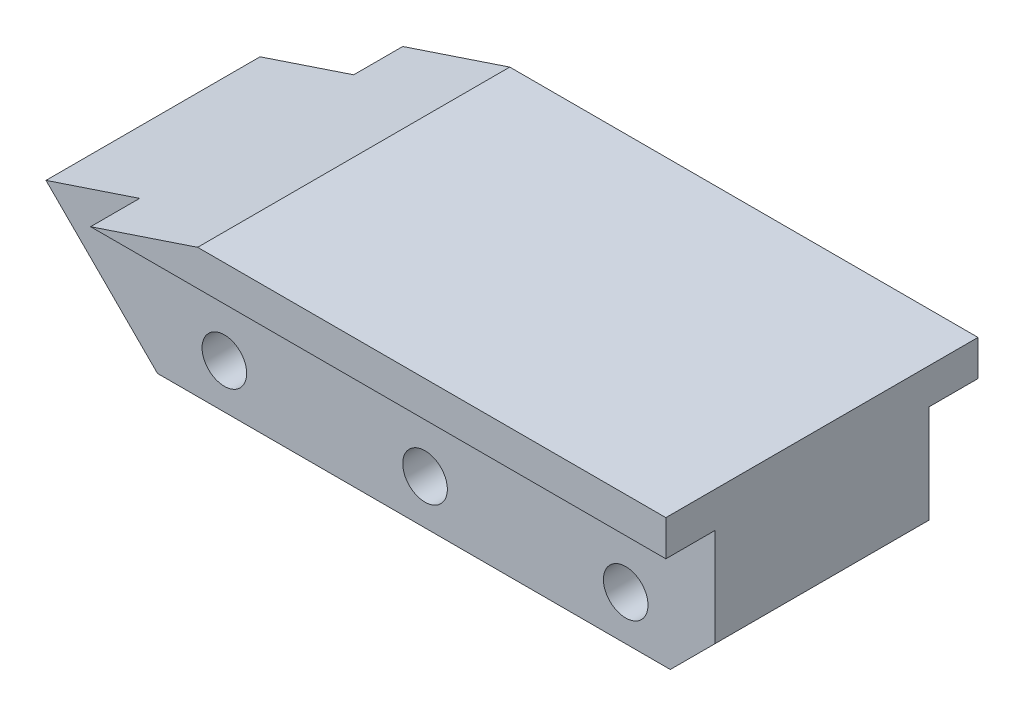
ISO-10303-21;
HEADER;
FILE_DESCRIPTION(('STEP AP214'),'2;1');
FILE_NAME('part.step','',(''),(''),'','','');
FILE_SCHEMA(('AUTOMOTIVE_DESIGN { 1 0 10303 214 1 1 1 1 }'));
ENDSEC;
DATA;
#1=APPLICATION_CONTEXT('core data for automotive mechanical design processes');
#2=APPLICATION_PROTOCOL_DEFINITION('international standard','automotive_design',2000,#1);
#3=PRODUCT_CONTEXT('',#1,'mechanical');
#4=PRODUCT('Part','Part','',(#3));
#5=PRODUCT_RELATED_PRODUCT_CATEGORY('part','',(#4));
#6=PRODUCT_DEFINITION_FORMATION('','',#4);
#7=PRODUCT_DEFINITION_CONTEXT('part definition',#1,'design');
#8=PRODUCT_DEFINITION('design','',#6,#7);
#9=PRODUCT_DEFINITION_SHAPE('','',#8);
#10=(LENGTH_UNIT() NAMED_UNIT(*) SI_UNIT(.MILLI.,.METRE.));
#11=(NAMED_UNIT(*) PLANE_ANGLE_UNIT() SI_UNIT($,.RADIAN.));
#12=(NAMED_UNIT(*) SI_UNIT($,.STERADIAN.) SOLID_ANGLE_UNIT());
#13=UNCERTAINTY_MEASURE_WITH_UNIT(LENGTH_MEASURE(1.E-05),#10,'distance_accuracy_value','');
#14=(GEOMETRIC_REPRESENTATION_CONTEXT(3) GLOBAL_UNCERTAINTY_ASSIGNED_CONTEXT((#13)) GLOBAL_UNIT_ASSIGNED_CONTEXT((#10,
#11,#12)) REPRESENTATION_CONTEXT('',''));
#15=CARTESIAN_POINT('',(0.,0.,0.));
#16=DIRECTION('',(0.,0.,1.));
#17=DIRECTION('',(1.,0.,0.));
#18=AXIS2_PLACEMENT_3D('',#15,#16,#17);
#19=CARTESIAN_POINT('',(100.120479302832,-22.0237691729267,70.));
#20=DIRECTION('',(0.,0.,1.));
#21=DIRECTION('',(1.,0.,0.));
#22=AXIS2_PLACEMENT_3D('',#19,#20,#21);
#23=PLANE('',#22);
#24=DIRECTION('',(1.,0.,0.));
#25=VECTOR('',#24,1.);
#26=CARTESIAN_POINT('',(-49.8795206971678,9.97623082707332,70.));
#27=LINE('',#26,#25);
#28=CARTESIAN_POINT('',(-28.8795206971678,9.97623082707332,70.));
#29=VERTEX_POINT('',#28);
#30=CARTESIAN_POINT('',(100.120479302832,9.97623082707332,70.));
#31=VERTEX_POINT('',#30);
#32=EDGE_CURVE('E163',#29,#31,#27,.T.);
#33=ORIENTED_EDGE('',*,*,#32,.T.);
#34=DIRECTION('',(0.,1.,0.));
#35=VECTOR('',#34,1.);
#36=CARTESIAN_POINT('',(100.120479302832,17.9762308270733,70.));
#37=LINE('',#36,#35);
#38=CARTESIAN_POINT('',(100.120479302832,17.9762308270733,70.));
#39=VERTEX_POINT('',#38);
#40=EDGE_CURVE('E146',#31,#39,#37,.T.);
#41=ORIENTED_EDGE('',*,*,#40,.T.);
#42=DIRECTION('',(-1.,0.,0.));
#43=VECTOR('',#42,1.);
#44=CARTESIAN_POINT('',(-4.87952069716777,17.9762308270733,70.));
#45=LINE('',#44,#43);
#46=CARTESIAN_POINT('',(-4.87952069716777,17.9762308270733,70.));
#47=VERTEX_POINT('',#46);
#48=EDGE_CURVE('E212',#39,#47,#45,.T.);
#49=ORIENTED_EDGE('',*,*,#48,.T.);
#50=DIRECTION('',(-0.948683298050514,-0.316227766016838,0.));
#51=VECTOR('',#50,1.);
#52=CARTESIAN_POINT('',(-49.8795206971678,2.97623082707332,70.));
#53=LINE('',#52,#51);
#54=EDGE_CURVE('E142',#47,#29,#53,.T.);
#55=ORIENTED_EDGE('',*,*,#54,.T.);
#56=EDGE_LOOP('',(#33,#41,#49,#55));
#57=FACE_BOUND('',#56,.T.);
#58=ADVANCED_FACE('F32',(#57),#23,.T.);
#59=CARTESIAN_POINT('',(100.120479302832,-22.0237691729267,0.));
#60=DIRECTION('',(0.,0.,1.));
#61=DIRECTION('',(1.,0.,0.));
#62=AXIS2_PLACEMENT_3D('',#59,#60,#61);
#63=PLANE('',#62);
#64=DIRECTION('',(0.,1.,0.));
#65=VECTOR('',#64,1.);
#66=CARTESIAN_POINT('',(100.120479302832,17.9762308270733,0.));
#67=LINE('',#66,#65);
#68=CARTESIAN_POINT('',(100.120479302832,9.97623082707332,0.));
#69=VERTEX_POINT('',#68);
#70=CARTESIAN_POINT('',(100.120479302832,17.9762308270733,0.));
#71=VERTEX_POINT('',#70);
#72=EDGE_CURVE('E127',#69,#71,#67,.T.);
#73=ORIENTED_EDGE('',*,*,#72,.F.);
#74=DIRECTION('',(1.,0.,0.));
#75=VECTOR('',#74,1.);
#76=CARTESIAN_POINT('',(-49.8795206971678,9.97623082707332,0.));
#77=LINE('',#76,#75);
#78=CARTESIAN_POINT('',(-28.8795206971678,9.97623082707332,0.));
#79=VERTEX_POINT('',#78);
#80=EDGE_CURVE('E108',#79,#69,#77,.T.);
#81=ORIENTED_EDGE('',*,*,#80,.F.);
#82=DIRECTION('',(-0.948683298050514,-0.316227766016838,0.));
#83=VECTOR('',#82,1.);
#84=CARTESIAN_POINT('',(-49.8795206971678,2.97623082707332,0.));
#85=LINE('',#84,#83);
#86=CARTESIAN_POINT('',(-4.87952069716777,17.9762308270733,0.));
#87=VERTEX_POINT('',#86);
#88=EDGE_CURVE('E136',#87,#79,#85,.T.);
#89=ORIENTED_EDGE('',*,*,#88,.F.);
#90=DIRECTION('',(-1.,0.,0.));
#91=VECTOR('',#90,1.);
#92=CARTESIAN_POINT('',(-4.87952069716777,17.9762308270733,0.));
#93=LINE('',#92,#91);
#94=EDGE_CURVE('E132',#71,#87,#93,.T.);
#95=ORIENTED_EDGE('',*,*,#94,.F.);
#96=EDGE_LOOP('',(#73,#81,#89,#95));
#97=FACE_BOUND('',#96,.T.);
#98=ADVANCED_FACE('F131',(#97),#63,.F.);
#99=CARTESIAN_POINT('',(100.120479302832,17.9762308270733,70.));
#100=DIRECTION('',(-1.,0.,0.));
#101=DIRECTION('',(0.,0.,1.));
#102=AXIS2_PLACEMENT_3D('',#99,#100,#101);
#103=PLANE('',#102);
#104=DIRECTION('',(0.,1.,0.));
#105=VECTOR('',#104,1.);
#106=CARTESIAN_POINT('',(100.120479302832,9.97623082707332,59.));
#107=LINE('',#106,#105);
#108=CARTESIAN_POINT('',(100.120479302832,-12.0237691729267,59.));
#109=VERTEX_POINT('',#108);
#110=CARTESIAN_POINT('',(100.120479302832,9.97623082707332,59.));
#111=VERTEX_POINT('',#110);
#112=EDGE_CURVE('E176',#109,#111,#107,.T.);
#113=ORIENTED_EDGE('',*,*,#112,.F.);
#114=DIRECTION('',(0.,0.,-1.));
#115=VECTOR('',#114,1.);
#116=CARTESIAN_POINT('',(100.120479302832,-12.0237691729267,70.));
#117=LINE('',#116,#115);
#118=CARTESIAN_POINT('',(100.120479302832,-12.0237691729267,11.));
#119=VERTEX_POINT('',#118);
#120=EDGE_CURVE('E172',#109,#119,#117,.T.);
#121=ORIENTED_EDGE('',*,*,#120,.T.);
#122=DIRECTION('',(0.,-1.,0.));
#123=VECTOR('',#122,1.);
#124=CARTESIAN_POINT('',(100.120479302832,9.97623082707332,11.));
#125=LINE('',#124,#123);
#126=CARTESIAN_POINT('',(100.120479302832,9.97623082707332,11.));
#127=VERTEX_POINT('',#126);
#128=EDGE_CURVE('E121',#127,#119,#125,.T.);
#129=ORIENTED_EDGE('',*,*,#128,.F.);
#130=DIRECTION('',(0.,0.,1.));
#131=VECTOR('',#130,1.);
#132=CARTESIAN_POINT('',(100.120479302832,9.97623082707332,0.));
#133=LINE('',#132,#131);
#134=EDGE_CURVE('E112',#69,#127,#133,.T.);
#135=ORIENTED_EDGE('',*,*,#134,.F.);
#136=ORIENTED_EDGE('',*,*,#72,.T.);
#137=DIRECTION('',(0.,0.,-1.));
#138=VECTOR('',#137,1.);
#139=CARTESIAN_POINT('',(100.120479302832,17.9762308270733,70.));
#140=LINE('',#139,#138);
#141=EDGE_CURVE('E156',#39,#71,#140,.T.);
#142=ORIENTED_EDGE('',*,*,#141,.F.);
#143=ORIENTED_EDGE('',*,*,#40,.F.);
#144=DIRECTION('',(0.,0.,1.));
#145=VECTOR('',#144,1.);
#146=CARTESIAN_POINT('',(100.120479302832,9.97623082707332,70.));
#147=LINE('',#146,#145);
#148=EDGE_CURVE('E196',#111,#31,#147,.T.);
#149=ORIENTED_EDGE('',*,*,#148,.F.);
#150=EDGE_LOOP('',(#113,#121,#129,#135,#136,#142,#143,#149));
#151=FACE_BOUND('',#150,.T.);
#152=ADVANCED_FACE('F125',(#151),#103,.F.);
#153=CARTESIAN_POINT('',(-4.87952069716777,17.9762308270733,70.));
#154=DIRECTION('',(0.,-1.,0.));
#155=DIRECTION('',(0.,0.,-1.));
#156=AXIS2_PLACEMENT_3D('',#153,#154,#155);
#157=PLANE('',#156);
#158=ORIENTED_EDGE('',*,*,#94,.T.);
#159=DIRECTION('',(0.,0.,-1.));
#160=VECTOR('',#159,1.);
#161=CARTESIAN_POINT('',(-4.87952069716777,17.9762308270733,70.));
#162=LINE('',#161,#160);
#163=EDGE_CURVE('E153',#47,#87,#162,.T.);
#164=ORIENTED_EDGE('',*,*,#163,.F.);
#165=ORIENTED_EDGE('',*,*,#48,.F.);
#166=ORIENTED_EDGE('',*,*,#141,.T.);
#167=EDGE_LOOP('',(#158,#164,#165,#166));
#168=FACE_BOUND('',#167,.T.);
#169=ADVANCED_FACE('F252',(#168),#157,.F.);
#170=CARTESIAN_POINT('',(-49.8795206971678,2.97623082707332,70.));
#171=DIRECTION('',(0.316227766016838,-0.948683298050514,0.));
#172=DIRECTION('',(0.948683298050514,0.316227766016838,0.));
#173=AXIS2_PLACEMENT_3D('',#170,#171,#172);
#174=PLANE('',#173);
#175=DIRECTION('',(0.,0.,1.));
#176=VECTOR('',#175,1.);
#177=CARTESIAN_POINT('',(-28.8795206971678,9.97623082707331,70.));
#178=LINE('',#177,#176);
#179=CARTESIAN_POINT('',(-28.8795206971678,9.97623082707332,11.));
#180=VERTEX_POINT('',#179);
#181=EDGE_CURVE('E115',#79,#180,#178,.T.);
#182=ORIENTED_EDGE('',*,*,#181,.T.);
#183=DIRECTION('',(-0.948683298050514,-0.316227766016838,0.));
#184=VECTOR('',#183,1.);
#185=CARTESIAN_POINT('',(-49.8795206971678,2.97623082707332,11.));
#186=LINE('',#185,#184);
#187=CARTESIAN_POINT('',(-49.8795206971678,2.97623082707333,11.));
#188=VERTEX_POINT('',#187);
#189=EDGE_CURVE('E192',#180,#188,#186,.T.);
#190=ORIENTED_EDGE('',*,*,#189,.T.);
#191=DIRECTION('',(0.,0.,-1.));
#192=VECTOR('',#191,1.);
#193=CARTESIAN_POINT('',(-49.8795206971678,2.97623082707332,70.));
#194=LINE('',#193,#192);
#195=CARTESIAN_POINT('',(-49.8795206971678,2.97623082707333,59.));
#196=VERTEX_POINT('',#195);
#197=EDGE_CURVE('E150',#196,#188,#194,.T.);
#198=ORIENTED_EDGE('',*,*,#197,.F.);
#199=DIRECTION('',(0.948683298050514,0.316227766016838,0.));
#200=VECTOR('',#199,1.);
#201=CARTESIAN_POINT('',(-49.8795206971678,2.97623082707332,59.));
#202=LINE('',#201,#200);
#203=CARTESIAN_POINT('',(-28.8795206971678,9.97623082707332,59.));
#204=VERTEX_POINT('',#203);
#205=EDGE_CURVE('E134',#196,#204,#202,.T.);
#206=ORIENTED_EDGE('',*,*,#205,.T.);
#207=DIRECTION('',(0.,0.,1.));
#208=VECTOR('',#207,1.);
#209=CARTESIAN_POINT('',(-28.8795206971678,9.97623082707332,70.));
#210=LINE('',#209,#208);
#211=EDGE_CURVE('E158',#204,#29,#210,.T.);
#212=ORIENTED_EDGE('',*,*,#211,.T.);
#213=ORIENTED_EDGE('',*,*,#54,.F.);
#214=ORIENTED_EDGE('',*,*,#163,.T.);
#215=ORIENTED_EDGE('',*,*,#88,.T.);
#216=EDGE_LOOP('',(#182,#190,#198,#206,#212,#213,#214,#215));
#217=FACE_BOUND('',#216,.T.);
#218=ADVANCED_FACE('F220',(#217),#174,.F.);
#219=CARTESIAN_POINT('',(-49.8795206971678,2.97623082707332,70.));
#220=DIRECTION('',(0.707106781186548,0.707106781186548,0.));
#221=DIRECTION('',(-0.707106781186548,0.707106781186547,0.));
#222=AXIS2_PLACEMENT_3D('',#219,#220,#221);
#223=PLANE('',#222);
#224=ORIENTED_EDGE('',*,*,#197,.T.);
#225=DIRECTION('',(0.707106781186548,-0.707106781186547,0.));
#226=VECTOR('',#225,1.);
#227=CARTESIAN_POINT('',(-49.8795206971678,2.97623082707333,11.));
#228=LINE('',#227,#226);
#229=CARTESIAN_POINT('',(-24.8795206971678,-22.0237691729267,11.));
#230=VERTEX_POINT('',#229);
#231=EDGE_CURVE('E189',#188,#230,#228,.T.);
#232=ORIENTED_EDGE('',*,*,#231,.T.);
#233=DIRECTION('',(0.,0.,-1.));
#234=VECTOR('',#233,1.);
#235=CARTESIAN_POINT('',(-24.8795206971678,-22.0237691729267,70.));
#236=LINE('',#235,#234);
#237=CARTESIAN_POINT('',(-24.8795206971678,-22.0237691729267,59.));
#238=VERTEX_POINT('',#237);
#239=EDGE_CURVE('E147',#238,#230,#236,.T.);
#240=ORIENTED_EDGE('',*,*,#239,.F.);
#241=DIRECTION('',(-0.707106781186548,0.707106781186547,0.));
#242=VECTOR('',#241,1.);
#243=CARTESIAN_POINT('',(-49.8795206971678,2.97623082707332,59.));
#244=LINE('',#243,#242);
#245=EDGE_CURVE('E139',#238,#196,#244,.T.);
#246=ORIENTED_EDGE('',*,*,#245,.T.);
#247=EDGE_LOOP('',(#224,#232,#240,#246));
#248=FACE_BOUND('',#247,.T.);
#249=ADVANCED_FACE('F246',(#248),#223,.F.);
#250=CARTESIAN_POINT('',(-24.8795206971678,-22.0237691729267,70.));
#251=DIRECTION('',(0.,1.,0.));
#252=DIRECTION('',(0.,0.,1.));
#253=AXIS2_PLACEMENT_3D('',#250,#251,#252);
#254=PLANE('',#253);
#255=DIRECTION('',(1.,0.,0.));
#256=VECTOR('',#255,1.);
#257=CARTESIAN_POINT('',(-49.8795206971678,-22.0237691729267,11.));
#258=LINE('',#257,#256);
#259=CARTESIAN_POINT('',(90.1204793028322,-22.0237691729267,11.));
#260=VERTEX_POINT('',#259);
#261=EDGE_CURVE('E170',#230,#260,#258,.T.);
#262=ORIENTED_EDGE('',*,*,#261,.T.);
#263=DIRECTION('',(0.,0.,1.));
#264=VECTOR('',#263,1.);
#265=CARTESIAN_POINT('',(90.1204793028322,-22.0237691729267,70.));
#266=LINE('',#265,#264);
#267=CARTESIAN_POINT('',(90.1204793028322,-22.0237691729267,59.));
#268=VERTEX_POINT('',#267);
#269=EDGE_CURVE('E40',#260,#268,#266,.T.);
#270=ORIENTED_EDGE('',*,*,#269,.T.);
#271=DIRECTION('',(1.,0.,0.));
#272=VECTOR('',#271,1.);
#273=CARTESIAN_POINT('',(-49.8795206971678,-22.0237691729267,59.));
#274=LINE('',#273,#272);
#275=EDGE_CURVE('E198',#238,#268,#274,.T.);
#276=ORIENTED_EDGE('',*,*,#275,.F.);
#277=ORIENTED_EDGE('',*,*,#239,.T.);
#278=EDGE_LOOP('',(#262,#270,#276,#277));
#279=FACE_BOUND('',#278,.T.);
#280=ADVANCED_FACE('F243',(#279),#254,.F.);
#281=CARTESIAN_POINT('',(80.1204793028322,-12.0237691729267,70.));
#282=DIRECTION('',(0.,0.,-1.));
#283=DIRECTION('',(-1.,0.,0.));
#284=AXIS2_PLACEMENT_3D('',#281,#282,#283);
#285=CYLINDRICAL_SURFACE('',#284,5.);
#286=CARTESIAN_POINT('',(80.1204793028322,-12.0237691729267,11.));
#287=DIRECTION('',(0.,0.,1.));
#288=DIRECTION('',(0.,-1.,0.));
#289=AXIS2_PLACEMENT_3D('',#286,#287,#288);
#290=CIRCLE('',#289,5.);
#291=CARTESIAN_POINT('',(80.1204793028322,-17.0237691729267,11.));
#292=VERTEX_POINT('',#291);
#293=EDGE_CURVE('E186',#292,#292,#290,.T.);
#294=ORIENTED_EDGE('',*,*,#293,.F.);
#295=EDGE_LOOP('',(#294));
#296=FACE_BOUND('',#295,.T.);
#297=CARTESIAN_POINT('',(80.1204793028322,-12.0237691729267,59.));
#298=DIRECTION('',(0.,0.,-1.));
#299=DIRECTION('',(-1.,0.,0.));
#300=AXIS2_PLACEMENT_3D('',#297,#298,#299);
#301=CIRCLE('',#300,5.);
#302=CARTESIAN_POINT('',(75.1204793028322,-12.0237691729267,59.));
#303=VERTEX_POINT('',#302);
#304=EDGE_CURVE('E207',#303,#303,#301,.T.);
#305=ORIENTED_EDGE('',*,*,#304,.F.);
#306=EDGE_LOOP('',(#305));
#307=FACE_BOUND('',#306,.T.);
#308=ADVANCED_FACE('F240',(#296,#307),#285,.F.);
#309=CARTESIAN_POINT('',(35.1204793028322,-12.0237691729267,70.));
#310=DIRECTION('',(0.,0.,-1.));
#311=DIRECTION('',(-1.,0.,0.));
#312=AXIS2_PLACEMENT_3D('',#309,#310,#311);
#313=CYLINDRICAL_SURFACE('',#312,5.);
#314=CARTESIAN_POINT('',(35.1204793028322,-12.0237691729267,11.));
#315=DIRECTION('',(0.,0.,1.));
#316=DIRECTION('',(0.,-1.,0.));
#317=AXIS2_PLACEMENT_3D('',#314,#315,#316);
#318=CIRCLE('',#317,5.);
#319=CARTESIAN_POINT('',(35.1204793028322,-17.0237691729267,11.));
#320=VERTEX_POINT('',#319);
#321=EDGE_CURVE('E169',#320,#320,#318,.T.);
#322=ORIENTED_EDGE('',*,*,#321,.F.);
#323=EDGE_LOOP('',(#322));
#324=FACE_BOUND('',#323,.T.);
#325=CARTESIAN_POINT('',(35.1204793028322,-12.0237691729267,59.));
#326=DIRECTION('',(0.,0.,-1.));
#327=DIRECTION('',(-1.,0.,0.));
#328=AXIS2_PLACEMENT_3D('',#325,#326,#327);
#329=CIRCLE('',#328,5.);
#330=CARTESIAN_POINT('',(30.1204793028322,-12.0237691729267,59.));
#331=VERTEX_POINT('',#330);
#332=EDGE_CURVE('E162',#331,#331,#329,.T.);
#333=ORIENTED_EDGE('',*,*,#332,.F.);
#334=EDGE_LOOP('',(#333));
#335=FACE_BOUND('',#334,.T.);
#336=ADVANCED_FACE('F282',(#324,#335),#313,.F.);
#337=CARTESIAN_POINT('',(-9.87952069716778,-12.0237691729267,70.));
#338=DIRECTION('',(0.,0.,-1.));
#339=DIRECTION('',(-1.,0.,0.));
#340=AXIS2_PLACEMENT_3D('',#337,#338,#339);
#341=CYLINDRICAL_SURFACE('',#340,5.);
#342=CARTESIAN_POINT('',(-9.87952069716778,-12.0237691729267,11.));
#343=DIRECTION('',(0.,0.,1.));
#344=DIRECTION('',(0.,-1.,0.));
#345=AXIS2_PLACEMENT_3D('',#342,#343,#344);
#346=CIRCLE('',#345,5.);
#347=CARTESIAN_POINT('',(-9.87952069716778,-17.0237691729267,11.));
#348=VERTEX_POINT('',#347);
#349=EDGE_CURVE('E166',#348,#348,#346,.T.);
#350=ORIENTED_EDGE('',*,*,#349,.F.);
#351=EDGE_LOOP('',(#350));
#352=FACE_BOUND('',#351,.T.);
#353=CARTESIAN_POINT('',(-9.87952069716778,-12.0237691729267,59.));
#354=DIRECTION('',(0.,0.,-1.));
#355=DIRECTION('',(-1.,0.,0.));
#356=AXIS2_PLACEMENT_3D('',#353,#354,#355);
#357=CIRCLE('',#356,5.);
#358=CARTESIAN_POINT('',(-14.8795206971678,-12.0237691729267,59.));
#359=VERTEX_POINT('',#358);
#360=EDGE_CURVE('E159',#359,#359,#357,.T.);
#361=ORIENTED_EDGE('',*,*,#360,.F.);
#362=EDGE_LOOP('',(#361));
#363=FACE_BOUND('',#362,.T.);
#364=ADVANCED_FACE('F289',(#352,#363),#341,.F.);
#365=CARTESIAN_POINT('',(-49.8795206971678,9.97623082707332,70.));
#366=DIRECTION('',(0.,1.,0.));
#367=DIRECTION('',(0.,0.,1.));
#368=AXIS2_PLACEMENT_3D('',#365,#366,#367);
#369=PLANE('',#368);
#370=DIRECTION('',(1.,0.,0.));
#371=VECTOR('',#370,1.);
#372=CARTESIAN_POINT('',(-49.8795206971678,9.97623082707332,59.));
#373=LINE('',#372,#371);
#374=EDGE_CURVE('E201',#204,#111,#373,.T.);
#375=ORIENTED_EDGE('',*,*,#374,.T.);
#376=ORIENTED_EDGE('',*,*,#148,.T.);
#377=ORIENTED_EDGE('',*,*,#32,.F.);
#378=ORIENTED_EDGE('',*,*,#211,.F.);
#379=EDGE_LOOP('',(#375,#376,#377,#378));
#380=FACE_BOUND('',#379,.T.);
#381=ADVANCED_FACE('F224',(#380),#369,.F.);
#382=CARTESIAN_POINT('',(-49.8795206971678,9.97623082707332,59.));
#383=DIRECTION('',(0.,0.,-1.));
#384=DIRECTION('',(-1.,0.,0.));
#385=AXIS2_PLACEMENT_3D('',#382,#383,#384);
#386=PLANE('',#385);
#387=ORIENTED_EDGE('',*,*,#304,.T.);
#388=EDGE_LOOP('',(#387));
#389=FACE_BOUND('',#388,.T.);
#390=ORIENTED_EDGE('',*,*,#332,.T.);
#391=EDGE_LOOP('',(#390));
#392=FACE_BOUND('',#391,.T.);
#393=ORIENTED_EDGE('',*,*,#360,.T.);
#394=EDGE_LOOP('',(#393));
#395=FACE_BOUND('',#394,.T.);
#396=ORIENTED_EDGE('',*,*,#275,.T.);
#397=DIRECTION('',(-0.707106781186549,-0.707106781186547,0.));
#398=VECTOR('',#397,1.);
#399=CARTESIAN_POINT('',(100.120479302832,-12.0237691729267,59.));
#400=LINE('',#399,#398);
#401=EDGE_CURVE('E11',#268,#109,#400,.F.);
#402=ORIENTED_EDGE('',*,*,#401,.T.);
#403=ORIENTED_EDGE('',*,*,#112,.T.);
#404=ORIENTED_EDGE('',*,*,#374,.F.);
#405=ORIENTED_EDGE('',*,*,#205,.F.);
#406=ORIENTED_EDGE('',*,*,#245,.F.);
#407=EDGE_LOOP('',(#396,#402,#403,#404,#405,#406));
#408=FACE_BOUND('',#407,.T.);
#409=ADVANCED_FACE('F226',(#389,#392,#395,#408),#386,.F.);
#410=CARTESIAN_POINT('',(-49.8795206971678,9.97623082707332,0.));
#411=DIRECTION('',(0.,1.,0.));
#412=DIRECTION('',(0.,0.,1.));
#413=AXIS2_PLACEMENT_3D('',#410,#411,#412);
#414=PLANE('',#413);
#415=ORIENTED_EDGE('',*,*,#80,.T.);
#416=ORIENTED_EDGE('',*,*,#134,.T.);
#417=DIRECTION('',(1.,0.,0.));
#418=VECTOR('',#417,1.);
#419=CARTESIAN_POINT('',(-49.8795206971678,9.97623082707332,11.));
#420=LINE('',#419,#418);
#421=EDGE_CURVE('E120',#180,#127,#420,.T.);
#422=ORIENTED_EDGE('',*,*,#421,.F.);
#423=ORIENTED_EDGE('',*,*,#181,.F.);
#424=EDGE_LOOP('',(#415,#416,#422,#423));
#425=FACE_BOUND('',#424,.T.);
#426=ADVANCED_FACE('F110',(#425),#414,.F.);
#427=CARTESIAN_POINT('',(-49.8795206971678,9.97623082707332,11.));
#428=DIRECTION('',(0.,0.,1.));
#429=DIRECTION('',(0.,-1.,0.));
#430=AXIS2_PLACEMENT_3D('',#427,#428,#429);
#431=PLANE('',#430);
#432=ORIENTED_EDGE('',*,*,#293,.T.);
#433=EDGE_LOOP('',(#432));
#434=FACE_BOUND('',#433,.T.);
#435=ORIENTED_EDGE('',*,*,#321,.T.);
#436=EDGE_LOOP('',(#435));
#437=FACE_BOUND('',#436,.T.);
#438=ORIENTED_EDGE('',*,*,#349,.T.);
#439=EDGE_LOOP('',(#438));
#440=FACE_BOUND('',#439,.T.);
#441=ORIENTED_EDGE('',*,*,#128,.T.);
#442=DIRECTION('',(0.707106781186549,0.707106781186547,0.));
#443=VECTOR('',#442,1.);
#444=CARTESIAN_POINT('',(100.120479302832,-12.0237691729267,11.));
#445=LINE('',#444,#443);
#446=EDGE_CURVE('E54',#119,#260,#445,.F.);
#447=ORIENTED_EDGE('',*,*,#446,.T.);
#448=ORIENTED_EDGE('',*,*,#261,.F.);
#449=ORIENTED_EDGE('',*,*,#231,.F.);
#450=ORIENTED_EDGE('',*,*,#189,.F.);
#451=ORIENTED_EDGE('',*,*,#421,.T.);
#452=EDGE_LOOP('',(#441,#447,#448,#449,#450,#451));
#453=FACE_BOUND('',#452,.T.);
#454=ADVANCED_FACE('F179',(#434,#437,#440,#453),#431,.F.);
#455=CARTESIAN_POINT('',(100.120479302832,-12.0237691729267,70.));
#456=DIRECTION('',(-0.707106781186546,0.707106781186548,0.));
#457=DIRECTION('',(-0.707106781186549,-0.707106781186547,0.));
#458=AXIS2_PLACEMENT_3D('',#455,#456,#457);
#459=PLANE('',#458);
#460=ORIENTED_EDGE('',*,*,#401,.F.);
#461=ORIENTED_EDGE('',*,*,#269,.F.);
#462=ORIENTED_EDGE('',*,*,#446,.F.);
#463=ORIENTED_EDGE('',*,*,#120,.F.);
#464=EDGE_LOOP('',(#460,#461,#462,#463));
#465=FACE_BOUND('',#464,.T.);
#466=ADVANCED_FACE('F34',(#465),#459,.F.);
#467=CLOSED_SHELL('',(#58,#98,#152,#169,#218,#249,#280,#308,#336,#364,#381,#409,#426,#454,#466));
#468=MANIFOLD_SOLID_BREP('B2',#467);
#469=ADVANCED_BREP_SHAPE_REPRESENTATION('',(#18,#468),#14);
#470=SHAPE_DEFINITION_REPRESENTATION(#9,#469);
ENDSEC;
END-ISO-10303-21;
